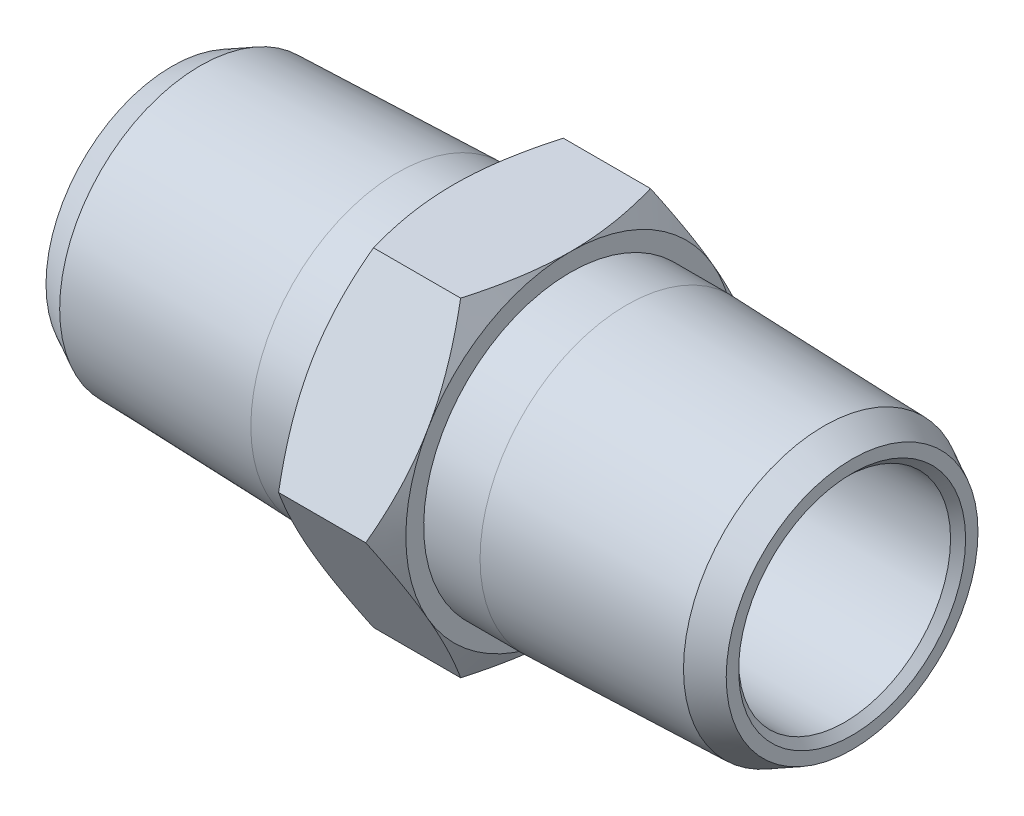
ISO-10303-21;
HEADER;
FILE_DESCRIPTION(('STEP AP214'),'2;1');
FILE_NAME('part.step','',(''),(''),'','','');
FILE_SCHEMA(('AUTOMOTIVE_DESIGN { 1 0 10303 214 1 1 1 1 }'));
ENDSEC;
DATA;
#1=APPLICATION_CONTEXT('core data for automotive mechanical design processes');
#2=APPLICATION_PROTOCOL_DEFINITION('international standard','automotive_design',2000,#1);
#3=PRODUCT_CONTEXT('',#1,'mechanical');
#4=PRODUCT('Part','Part','',(#3));
#5=PRODUCT_RELATED_PRODUCT_CATEGORY('part','',(#4));
#6=PRODUCT_DEFINITION_FORMATION('','',#4);
#7=PRODUCT_DEFINITION_CONTEXT('part definition',#1,'design');
#8=PRODUCT_DEFINITION('design','',#6,#7);
#9=PRODUCT_DEFINITION_SHAPE('','',#8);
#10=(LENGTH_UNIT() NAMED_UNIT(*) SI_UNIT(.MILLI.,.METRE.));
#11=(NAMED_UNIT(*) PLANE_ANGLE_UNIT() SI_UNIT($,.RADIAN.));
#12=(NAMED_UNIT(*) SI_UNIT($,.STERADIAN.) SOLID_ANGLE_UNIT());
#13=UNCERTAINTY_MEASURE_WITH_UNIT(LENGTH_MEASURE(1.E-05),#10,'distance_accuracy_value','');
#14=(GEOMETRIC_REPRESENTATION_CONTEXT(3) GLOBAL_UNCERTAINTY_ASSIGNED_CONTEXT((#13)) GLOBAL_UNIT_ASSIGNED_CONTEXT((#10,
#11,#12)) REPRESENTATION_CONTEXT('',''));
#15=CARTESIAN_POINT('',(0.,0.,0.));
#16=DIRECTION('',(0.,0.,1.));
#17=DIRECTION('',(1.,0.,0.));
#18=AXIS2_PLACEMENT_3D('',#15,#16,#17);
#19=CARTESIAN_POINT('',(0.,0.,-12.8316097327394));
#20=DIRECTION('',(0.,-0.5,-0.866025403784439));
#21=DIRECTION('',(0.,0.866025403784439,-0.5));
#22=AXIS2_PLACEMENT_3D('',#19,#20,#21);
#23=PLANE('',#22);
#24=CARTESIAN_POINT('',(-2.94447154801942,-2.12642103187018E-08,-12.8316097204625));
#25=CARTESIAN_POINT('',(-3.09528296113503,-0.452484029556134,-12.5703679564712));
#26=CARTESIAN_POINT('',(-3.23343498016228,-0.908289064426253,-12.307208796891));
#27=CARTESIAN_POINT('',(-3.41630997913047,-1.59559749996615,-11.9103910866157));
#28=CARTESIAN_POINT('',(-3.47309937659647,-1.82473210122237,-11.7781001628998));
#29=CARTESIAN_POINT('',(-3.57790298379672,-2.28450344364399,-11.512651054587));
#30=CARTESIAN_POINT('',(-3.62591772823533,-2.51514009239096,-11.3794929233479));
#31=CARTESIAN_POINT('',(-3.71240689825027,-2.97804211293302,-11.1122363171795));
#32=CARTESIAN_POINT('',(-3.75086974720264,-3.21030911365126,-10.978136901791));
#33=CARTESIAN_POINT('',(-3.81744708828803,-3.67595403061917,-10.7092966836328));
#34=CARTESIAN_POINT('',(-3.8455618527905,-3.90933191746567,-10.574555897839));
#35=CARTESIAN_POINT('',(-3.89095324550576,-4.3780631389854,-10.303933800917));
#36=CARTESIAN_POINT('',(-3.90817475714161,-4.61342050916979,-10.1680501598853));
#37=CARTESIAN_POINT('',(-3.93122211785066,-5.08459812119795,-9.89601563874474));
#38=CARTESIAN_POINT('',(-3.93704571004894,-5.32041844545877,-9.75986471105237));
#39=CARTESIAN_POINT('',(-3.93700001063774,-5.55624999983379,-9.62370729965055));
#40=B_SPLINE_CURVE_WITH_KNOTS('',3,(#24,#25,#26,#27,#28,#29,#30,#31,#32,#33,#34,#35,#36,#37,#38,
#39),.UNSPECIFIED.,.F.,.F.,(4,2,2,2,2,2,2,4),(0.,1.63139646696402,2.44310867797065,
3.2547714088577,4.06741310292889,4.88003340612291,5.69673310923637,6.51359450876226),.UNSPECIFIED.);
#41=CARTESIAN_POINT('',(-2.94447154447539,1.06320868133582E-08,-12.831609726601));
#42=VERTEX_POINT('',#41);
#43=CARTESIAN_POINT('',(-3.93700000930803,-5.55625000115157,-9.62370730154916));
#44=VERTEX_POINT('',#43);
#45=EDGE_CURVE('E289',#42,#44,#40,.T.);
#46=ORIENTED_EDGE('',*,*,#45,.F.);
#47=DIRECTION('',(1.,0.,0.));
#48=VECTOR('',#47,1.);
#49=CARTESIAN_POINT('',(0.,0.,-12.8316097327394));
#50=LINE('',#49,#48);
#51=CARTESIAN_POINT('',(2.9444715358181,1.53397640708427E-08,-12.8316097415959));
#52=VERTEX_POINT('',#51);
#53=EDGE_CURVE('E134',#52,#42,#50,.F.);
#54=ORIENTED_EDGE('',*,*,#53,.F.);
#55=CARTESIAN_POINT('',(3.93700000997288,-5.55624999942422,-9.6237072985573));
#56=CARTESIAN_POINT('',(3.93704570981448,-5.3204184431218,-9.75986471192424));
#57=CARTESIAN_POINT('',(3.93122211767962,-5.08459811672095,-9.89601564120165));
#58=CARTESIAN_POINT('',(3.90817475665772,-4.613420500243,-10.1680501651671));
#59=CARTESIAN_POINT('',(3.89095324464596,-4.37806312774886,-10.3039338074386));
#60=CARTESIAN_POINT('',(3.84556185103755,-3.90933190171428,-10.5745559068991));
#61=CARTESIAN_POINT('',(3.81744708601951,-3.67595401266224,-10.7092966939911));
#62=CARTESIAN_POINT('',(3.75086974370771,-3.21030909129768,-10.9781369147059));
#63=CARTESIAN_POINT('',(3.71240689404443,-2.97804208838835,-11.1122363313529));
#64=CARTESIAN_POINT('',(3.62591772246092,-2.51514006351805,-11.3794929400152));
#65=CARTESIAN_POINT('',(3.57790297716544,-2.28450341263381,-11.51265107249));
#66=CARTESIAN_POINT('',(3.47309936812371,-1.82473206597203,-11.7781001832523));
#67=CARTESIAN_POINT('',(3.41630996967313,-1.59559746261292,-11.9103911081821));
#68=CARTESIAN_POINT('',(3.23343496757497,-0.908289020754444,-12.3072088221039));
#69=CARTESIAN_POINT('',(3.09528294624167,-0.452483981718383,-12.5703679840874));
#70=CARTESIAN_POINT('',(2.94447153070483,3.06795427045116E-08,-12.8316097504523));
#71=B_SPLINE_CURVE_WITH_KNOTS('',3,(#55,#56,#57,#58,#59,#60,#61,#62,#63,#64,#65,#66,#67,#68,#69,
#70),.UNSPECIFIED.,.F.,.F.,(4,2,2,2,2,2,2,4),(0.,0.81686140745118,1.63356111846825,
2.44618142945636,3.25882313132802,4.07048586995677,4.88219808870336,6.51359457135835),.UNSPECIFIED.);
#72=CARTESIAN_POINT('',(3.93700000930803,-5.55625000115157,-9.62370730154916));
#73=VERTEX_POINT('',#72);
#74=EDGE_CURVE('E132',#73,#52,#71,.T.);
#75=ORIENTED_EDGE('',*,*,#74,.F.);
#76=CARTESIAN_POINT('',(2.94447156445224,-11.1124999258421,-6.41580490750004));
#77=CARTESIAN_POINT('',(3.09528297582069,-10.6600159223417,-6.67704666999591));
#78=CARTESIAN_POINT('',(3.23343499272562,-10.204210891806,-6.94020582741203));
#79=CARTESIAN_POINT('',(3.41630998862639,-9.51690246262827,-7.33702353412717));
#80=CARTESIAN_POINT('',(3.47309938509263,-9.28776786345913,-7.46931445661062));
#81=CARTESIAN_POINT('',(3.57790299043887,-8.8279965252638,-7.73476356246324));
#82=CARTESIAN_POINT('',(3.62591773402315,-8.59735987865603,-7.8679216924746));
#83=CARTESIAN_POINT('',(3.7124069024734,-8.13445786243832,-8.13517829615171));
#84=CARTESIAN_POINT('',(3.7508697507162,-7.90219086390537,-8.2692777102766));
#85=CARTESIAN_POINT('',(3.81744709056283,-7.43654595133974,-8.53811792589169));
#86=CARTESIAN_POINT('',(3.84556185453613,-7.20316806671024,-8.67285871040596));
#87=CARTESIAN_POINT('',(3.89095324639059,-6.73443684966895,-8.94348080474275));
#88=CARTESIAN_POINT('',(3.90817475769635,-6.49907948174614,-9.07936444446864));
#89=CARTESIAN_POINT('',(3.93122211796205,-6.02790187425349,-9.35139896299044));
#90=CARTESIAN_POINT('',(3.93704571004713,-5.7920815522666,-9.48754988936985));
#91=CARTESIAN_POINT('',(3.93700001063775,-5.55625000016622,-9.62370729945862));
#92=B_SPLINE_CURVE_WITH_KNOTS('',3,(#76,#77,#78,#79,#80,#81,#82,#83,#84,#85,#86,#87,#88,#89,#90,
#91),.UNSPECIFIED.,.F.,.F.,(4,2,2,2,2,2,2,4),(0.,1.63139645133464,2.44310865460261,
3.25477137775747,4.06741306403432,4.88003335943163,5.69673305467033,6.51359444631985),.UNSPECIFIED.);
#93=CARTESIAN_POINT('',(2.9444715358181,-11.1125,-6.41580488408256));
#94=VERTEX_POINT('',#93);
#95=EDGE_CURVE('E20',#94,#73,#92,.T.);
#96=ORIENTED_EDGE('',*,*,#95,.F.);
#97=DIRECTION('',(1.,0.,0.));
#98=VECTOR('',#97,1.);
#99=CARTESIAN_POINT('',(0.,-11.1125,-6.41580486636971));
#100=LINE('',#99,#98);
#101=CARTESIAN_POINT('',(-2.94447155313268,-11.112499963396,-6.41580488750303));
#102=VERTEX_POINT('',#101);
#103=EDGE_CURVE('E109',#102,#94,#100,.T.);
#104=ORIENTED_EDGE('',*,*,#103,.F.);
#105=CARTESIAN_POINT('',(-3.93700000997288,-5.55624999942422,-9.62370729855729));
#106=CARTESIAN_POINT('',(-3.93704570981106,-5.79208155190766,-9.4875498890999));
#107=CARTESIAN_POINT('',(-3.9312221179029,-6.02790187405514,-9.35139896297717));
#108=CARTESIAN_POINT('',(-3.90817475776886,-6.49907948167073,-9.07936444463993));
#109=CARTESIAN_POINT('',(-3.89095324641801,-6.73443684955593,-8.94348080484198));
#110=CARTESIAN_POINT('',(-3.84556185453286,-7.20316806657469,-8.67285871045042));
#111=CARTESIAN_POINT('',(-3.81744709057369,-7.43654595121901,-8.53811792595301));
#112=CARTESIAN_POINT('',(-3.75086975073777,-7.90219086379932,-8.26927771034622));
#113=CARTESIAN_POINT('',(-3.71240690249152,-8.13445786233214,-8.13517829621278));
#114=CARTESIAN_POINT('',(-3.62591773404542,-8.597359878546,-7.86792169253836));
#115=CARTESIAN_POINT('',(-3.57790299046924,-8.82799652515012,-7.7347635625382));
#116=CARTESIAN_POINT('',(-3.47309938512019,-9.28776786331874,-7.46931445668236));
#117=CARTESIAN_POINT('',(-3.41630998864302,-9.5169024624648,-7.33702353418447));
#118=CARTESIAN_POINT('',(-3.2334349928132,-10.2042108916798,-6.94020582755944));
#119=CARTESIAN_POINT('',(-3.09528297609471,-10.6600159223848,-6.67704667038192));
#120=CARTESIAN_POINT('',(-2.94447156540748,-11.1124999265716,-6.41580490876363));
#121=B_SPLINE_CURVE_WITH_KNOTS('',3,(#105,#106,#107,#108,#109,#110,#111,#112,#113,#114,#115,
#116,#117,#118,#119,#120),.UNSPECIFIED.,.F.,.F.,(4,2,2,2,2,2,2,4),(0.,0.816861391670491,
1.63356108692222,2.44618138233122,3.25882306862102,4.07048579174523,4.88219799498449,
6.51359444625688),.UNSPECIFIED.);
#122=EDGE_CURVE('E192',#44,#102,#121,.T.);
#123=ORIENTED_EDGE('',*,*,#122,.F.);
#124=EDGE_LOOP('',(#46,#54,#75,#96,#104,#123));
#125=FACE_BOUND('',#124,.T.);
#126=ADVANCED_FACE('F16',(#125),#23,.T.);
#127=CARTESIAN_POINT('',(0.,11.1125,-6.41580486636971));
#128=DIRECTION('',(0.,0.5,-0.866025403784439));
#129=DIRECTION('',(0.,0.866025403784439,0.5));
#130=AXIS2_PLACEMENT_3D('',#127,#128,#129);
#131=PLANE('',#130);
#132=CARTESIAN_POINT('',(-2.94447153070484,11.1125000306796,-6.41580484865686));
#133=CARTESIAN_POINT('',(-3.09528294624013,10.6600160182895,-6.67704661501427));
#134=CARTESIAN_POINT('',(-3.2334349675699,10.2042109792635,-6.94020577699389));
#135=CARTESIAN_POINT('',(-3.41630996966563,9.51690253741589,-7.33702349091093));
#136=CARTESIAN_POINT('',(-3.47309936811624,9.28776793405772,-7.46931441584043));
#137=CARTESIAN_POINT('',(-3.57790297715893,8.82799658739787,-7.73476352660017));
#138=CARTESIAN_POINT('',(-3.62591772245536,8.59735993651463,-7.8679216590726));
#139=CARTESIAN_POINT('',(-3.71240689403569,8.13445791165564,-8.13517826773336));
#140=CARTESIAN_POINT('',(-3.75086974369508,7.90219090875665,-8.26927768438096));
#141=CARTESIAN_POINT('',(-3.81744708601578,7.43654598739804,-8.53811790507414));
#142=CARTESIAN_POINT('',(-3.84556185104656,7.20316809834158,-8.67285869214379));
#143=CARTESIAN_POINT('',(-3.89095324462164,6.73443687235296,-8.94348079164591));
#144=CARTESIAN_POINT('',(-3.90817475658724,6.49907949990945,-9.07936443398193));
#145=CARTESIAN_POINT('',(-3.93122211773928,6.02790188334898,-9.35139895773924));
#146=CARTESIAN_POINT('',(-3.93704571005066,5.79208155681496,-9.48754988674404));
#147=CARTESIAN_POINT('',(-3.93700001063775,5.55625000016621,-9.62370729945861));
#148=B_SPLINE_CURVE_WITH_KNOTS('',3,(#132,#133,#134,#135,#136,#137,#138,#139,#140,#141,#142,
#143,#144,#145,#146,#147),.UNSPECIFIED.,.F.,.F.,(4,2,2,2,2,2,2,4),(0.,1.6313964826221,
2.44310870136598,3.25477143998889,4.06741314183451,4.8800334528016,5.69673316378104,
6.51359457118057),.UNSPECIFIED.);
#149=CARTESIAN_POINT('',(-2.94447155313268,11.1125,-6.41580482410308));
#150=VERTEX_POINT('',#149);
#151=CARTESIAN_POINT('',(-3.93700000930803,5.55625000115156,-9.62370730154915));
#152=VERTEX_POINT('',#151);
#153=EDGE_CURVE('E278',#150,#152,#148,.T.);
#154=ORIENTED_EDGE('',*,*,#153,.F.);
#155=DIRECTION('',(1.,0.,0.));
#156=VECTOR('',#155,1.);
#157=CARTESIAN_POINT('',(0.,11.1125,-6.41580486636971));
#158=LINE('',#157,#156);
#159=CARTESIAN_POINT('',(2.9444715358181,11.1125000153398,-6.41580485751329));
#160=VERTEX_POINT('',#159);
#161=EDGE_CURVE('E394',#160,#150,#158,.F.);
#162=ORIENTED_EDGE('',*,*,#161,.F.);
#163=CARTESIAN_POINT('',(3.9370000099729,5.55624999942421,-9.62370729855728));
#164=CARTESIAN_POINT('',(3.93704570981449,5.79208155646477,-9.48754988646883));
#165=CARTESIAN_POINT('',(3.93122211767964,6.02790188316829,-9.35139895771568));
#166=CARTESIAN_POINT('',(3.90817475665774,6.49907949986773,-9.07936443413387));
#167=CARTESIAN_POINT('',(3.89095324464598,6.73443687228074,-8.94348079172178));
#168=CARTESIAN_POINT('',(3.84556185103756,7.20316809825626,-8.67285869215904));
#169=CARTESIAN_POINT('',(3.81744708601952,7.43654598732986,-8.53811790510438));
#170=CARTESIAN_POINT('',(3.75086974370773,7.90219090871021,-8.26927768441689));
#171=CARTESIAN_POINT('',(3.71240689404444,8.13445791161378,-8.13517826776));
#172=CARTESIAN_POINT('',(3.62591772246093,8.59735993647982,-7.86792165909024));
#173=CARTESIAN_POINT('',(3.57790297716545,8.82799658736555,-7.73476352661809));
#174=CARTESIAN_POINT('',(3.47309936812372,9.28776793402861,-7.46931441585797));
#175=CARTESIAN_POINT('',(3.41630996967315,9.5169025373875,-7.33702349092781));
#176=CARTESIAN_POINT('',(3.23343496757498,10.2042109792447,-6.94020577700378));
#177=CARTESIAN_POINT('',(3.09528294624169,10.660016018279,-6.67704661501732));
#178=CARTESIAN_POINT('',(2.94447153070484,11.1125000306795,-6.41580484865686));
#179=B_SPLINE_CURVE_WITH_KNOTS('',3,(#163,#164,#165,#166,#167,#168,#169,#170,#171,#172,#173,
#174,#175,#176,#177,#178),.UNSPECIFIED.,.F.,.F.,(4,2,2,2,2,2,2,4),(0.,0.816861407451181,
1.63356111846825,2.44618142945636,3.25882313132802,4.07048586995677,4.88219808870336,
6.51359457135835),.UNSPECIFIED.);
#180=CARTESIAN_POINT('',(3.93700000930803,5.55625000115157,-9.62370730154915));
#181=VERTEX_POINT('',#180);
#182=EDGE_CURVE('E327',#181,#160,#179,.T.);
#183=ORIENTED_EDGE('',*,*,#182,.F.);
#184=CARTESIAN_POINT('',(2.94447156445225,7.26988509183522E-08,-12.831609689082));
#185=CARTESIAN_POINT('',(3.09528297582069,0.452484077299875,-12.5703679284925));
#186=CARTESIAN_POINT('',(3.23343499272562,0.908289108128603,-12.3072087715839));
#187=CARTESIAN_POINT('',(3.41630998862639,1.59559753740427,-11.9103910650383));
#188=CARTESIAN_POINT('',(3.47309938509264,1.82473213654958,-11.7781001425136));
#189=CARTESIAN_POINT('',(3.57790299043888,2.28450347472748,-11.5126510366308));
#190=CARTESIAN_POINT('',(3.62591773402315,2.51514012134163,-11.3794929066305));
#191=CARTESIAN_POINT('',(3.7124069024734,2.97804213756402,-11.1122363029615));
#192=CARTESIAN_POINT('',(3.75086975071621,3.21030913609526,-10.9781368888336));
#193=CARTESIAN_POINT('',(3.81744709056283,3.67595404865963,-10.7092966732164));
#194=CARTESIAN_POINT('',(3.84556185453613,3.90933193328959,-10.5745558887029));
#195=CARTESIAN_POINT('',(3.8909532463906,4.37806315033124,-10.3039337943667));
#196=CARTESIAN_POINT('',(3.90817475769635,4.61342051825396,-10.1680501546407));
#197=CARTESIAN_POINT('',(3.93122211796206,5.08459812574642,-9.89601563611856));
#198=CARTESIAN_POINT('',(3.93704571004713,5.32041844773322,-9.75986470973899));
#199=CARTESIAN_POINT('',(3.93700001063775,5.55624999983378,-9.62370729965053));
#200=B_SPLINE_CURVE_WITH_KNOTS('',3,(#184,#185,#186,#187,#188,#189,#190,#191,#192,#193,#194,
#195,#196,#197,#198,#199),.UNSPECIFIED.,.F.,.F.,(4,2,2,2,2,2,2,4),(0.,1.63139645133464,
2.4431086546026,3.25477137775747,4.06741306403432,4.88003335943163,5.69673305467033,
6.51359444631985),.UNSPECIFIED.);
#201=EDGE_CURVE('E128',#52,#181,#200,.T.);
#202=ORIENTED_EDGE('',*,*,#201,.F.);
#203=ORIENTED_EDGE('',*,*,#53,.T.);
#204=CARTESIAN_POINT('',(-3.93700000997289,5.55624999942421,-9.62370729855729));
#205=CARTESIAN_POINT('',(-3.93704570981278,5.32041844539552,-9.75986471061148));
#206=CARTESIAN_POINT('',(-3.93122211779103,5.08459812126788,-9.89601563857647));
#207=CARTESIAN_POINT('',(-3.90817475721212,4.61342050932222,-10.1680501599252));
#208=CARTESIAN_POINT('',(-3.89095324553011,4.3780631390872,-10.3039338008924));
#209=CARTESIAN_POINT('',(-3.84556185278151,3.90933191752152,-10.5745558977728));
#210=CARTESIAN_POINT('',(-3.81744708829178,3.67595403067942,-10.7092966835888));
#211=CARTESIAN_POINT('',(-3.7508697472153,3.21030911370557,-10.9781369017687));
#212=CARTESIAN_POINT('',(-3.71240689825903,2.97804211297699,-11.1122363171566));
#213=CARTESIAN_POINT('',(-3.6259177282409,2.51514009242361,-11.3794929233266));
#214=CARTESIAN_POINT('',(-3.57790298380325,2.28450344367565,-11.5126510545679));
#215=CARTESIAN_POINT('',(-3.47309937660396,1.82473210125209,-11.7781001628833));
#216=CARTESIAN_POINT('',(-3.41630997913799,1.59559749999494,-11.9103910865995));
#217=CARTESIAN_POINT('',(-3.23343498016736,0.908289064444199,-12.3072087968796));
#218=CARTESIAN_POINT('',(-3.09528296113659,0.452484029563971,-12.5703679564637));
#219=CARTESIAN_POINT('',(-2.94447154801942,2.1264189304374E-08,-12.8316097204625));
#220=B_SPLINE_CURVE_WITH_KNOTS('',3,(#204,#205,#206,#207,#208,#209,#210,#211,#212,#213,#214,
#215,#216,#217,#218,#219),.UNSPECIFIED.,.F.,.F.,(4,2,2,2,2,2,2,4),(0.,0.816861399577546,
1.63356110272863,2.44618140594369,3.25882310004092,4.07048583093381,4.88219804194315,
6.51359450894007),.UNSPECIFIED.);
#221=EDGE_CURVE('E293',#152,#42,#220,.T.);
#222=ORIENTED_EDGE('',*,*,#221,.F.);
#223=EDGE_LOOP('',(#154,#162,#183,#202,#203,#222));
#224=FACE_BOUND('',#223,.T.);
#225=ADVANCED_FACE('F300',(#224),#131,.T.);
#226=CARTESIAN_POINT('',(0.,11.1125,6.41580486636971));
#227=DIRECTION('',(0.,1.,0.));
#228=DIRECTION('',(0.,0.,1.));
#229=AXIS2_PLACEMENT_3D('',#226,#227,#228);
#230=PLANE('',#229);
#231=CARTESIAN_POINT('',(-2.94447156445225,11.112499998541,6.41580478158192));
#232=CARTESIAN_POINT('',(-3.0952829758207,11.1124999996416,5.89332125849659));
#233=CARTESIAN_POINT('',(-3.23343499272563,11.1124999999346,5.36700294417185));
#234=CARTESIAN_POINT('',(-3.4163099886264,11.1125000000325,4.57336753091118));
#235=CARTESIAN_POINT('',(-3.47309938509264,11.1125000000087,4.30878568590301));
#236=CARTESIAN_POINT('',(-3.57790299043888,11.1124999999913,3.77788747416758));
#237=CARTESIAN_POINT('',(-3.62591773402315,11.1124999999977,3.51157121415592));
#238=CARTESIAN_POINT('',(-3.7124069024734,11.1125000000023,2.97705800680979));
#239=CARTESIAN_POINT('',(-3.75086975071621,11.1125000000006,2.70885917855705));
#240=CARTESIAN_POINT('',(-3.81744709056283,11.1124999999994,2.17117874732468));
#241=CARTESIAN_POINT('',(-3.84556185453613,11.1124999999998,1.90169717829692));
#242=CARTESIAN_POINT('',(-3.8909532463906,11.1125000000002,1.36045298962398));
#243=CARTESIAN_POINT('',(-3.90817475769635,11.1125000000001,1.08868571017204));
#244=CARTESIAN_POINT('',(-3.93122211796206,11.1124999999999,0.544616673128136));
#245=CARTESIAN_POINT('',(-3.93704571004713,11.1124999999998,0.272314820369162));
#246=CARTESIAN_POINT('',(-3.93700001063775,11.1125,1.91929935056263E-10));
#247=B_SPLINE_CURVE_WITH_KNOTS('',3,(#231,#232,#233,#234,#235,#236,#237,#238,#239,#240,#241,
#242,#243,#244,#245,#246),.UNSPECIFIED.,.F.,.F.,(4,2,2,2,2,2,2,4),(0.,1.63139645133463,
2.4431086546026,3.25477137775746,4.06741306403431,4.88003335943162,5.69673305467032,
6.51359444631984),.UNSPECIFIED.);
#248=CARTESIAN_POINT('',(-2.94447153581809,11.1125000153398,6.4158048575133));
#249=VERTEX_POINT('',#248);
#250=CARTESIAN_POINT('',(-3.93700000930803,11.1125000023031,0.));
#251=VERTEX_POINT('',#250);
#252=EDGE_CURVE('E258',#249,#251,#247,.T.);
#253=ORIENTED_EDGE('',*,*,#252,.F.);
#254=DIRECTION('',(1.,0.,0.));
#255=VECTOR('',#254,1.);
#256=CARTESIAN_POINT('',(0.,11.1125,6.41580486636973));
#257=LINE('',#256,#255);
#258=CARTESIAN_POINT('',(2.94447155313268,11.1125,6.41580482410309));
#259=VERTEX_POINT('',#258);
#260=EDGE_CURVE('E396',#259,#249,#257,.F.);
#261=ORIENTED_EDGE('',*,*,#260,.F.);
#262=CARTESIAN_POINT('',(3.93700000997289,11.1124999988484,0.));
#263=CARTESIAN_POINT('',(3.93704570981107,11.1124999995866,0.272314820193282));
#264=CARTESIAN_POINT('',(3.93122211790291,11.1124999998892,0.54461667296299));
#265=CARTESIAN_POINT('',(3.90817475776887,11.1125000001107,1.08868571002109));
#266=CARTESIAN_POINT('',(3.89095324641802,11.1125000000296,1.36045298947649));
#267=CARTESIAN_POINT('',(3.84556185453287,11.1124999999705,1.90169717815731));
#268=CARTESIAN_POINT('',(3.81744709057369,11.1124999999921,2.17117874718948));
#269=CARTESIAN_POINT('',(3.75086975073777,11.1125000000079,2.7088591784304));
#270=CARTESIAN_POINT('',(3.71240690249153,11.1125000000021,2.97705800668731));
#271=CARTESIAN_POINT('',(3.62591773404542,11.1124999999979,3.51157121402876));
#272=CARTESIAN_POINT('',(3.57790299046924,11.1124999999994,3.77788747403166));
#273=CARTESIAN_POINT('',(3.47309938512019,11.1125000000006,4.30878568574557));
#274=CARTESIAN_POINT('',(3.41630998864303,11.1125000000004,4.57336753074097));
#275=CARTESIAN_POINT('',(3.2334349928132,11.1124999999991,5.36700294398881));
#276=CARTESIAN_POINT('',(3.09528297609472,11.1124999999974,5.89332125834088));
#277=CARTESIAN_POINT('',(2.94447156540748,11.1125,6.41580478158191));
#278=B_SPLINE_CURVE_WITH_KNOTS('',3,(#262,#263,#264,#265,#266,#267,#268,#269,#270,#271,#272,
#273,#274,#275,#276,#277),.UNSPECIFIED.,.F.,.F.,(4,2,2,2,2,2,2,4),(0.,0.816861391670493,
1.63356108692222,2.44618138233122,3.25882306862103,4.07048579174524,4.8821979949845,
6.51359444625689),.UNSPECIFIED.);
#279=CARTESIAN_POINT('',(3.93700000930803,11.1125000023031,0.));
#280=VERTEX_POINT('',#279);
#281=EDGE_CURVE('E332',#280,#259,#278,.T.);
#282=ORIENTED_EDGE('',*,*,#281,.F.);
#283=CARTESIAN_POINT('',(2.94447156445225,11.1124999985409,-6.41580478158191));
#284=CARTESIAN_POINT('',(3.0952829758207,11.1124999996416,-5.89332125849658));
#285=CARTESIAN_POINT('',(3.23343499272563,11.1124999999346,-5.36700294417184));
#286=CARTESIAN_POINT('',(3.4163099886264,11.1125000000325,-4.57336753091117));
#287=CARTESIAN_POINT('',(3.47309938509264,11.1125000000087,-4.30878568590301));
#288=CARTESIAN_POINT('',(3.57790299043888,11.1124999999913,-3.77788747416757));
#289=CARTESIAN_POINT('',(3.62591773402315,11.1124999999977,-3.51157121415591));
#290=CARTESIAN_POINT('',(3.7124069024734,11.1125000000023,-2.97705800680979));
#291=CARTESIAN_POINT('',(3.75086975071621,11.1125000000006,-2.70885917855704));
#292=CARTESIAN_POINT('',(3.81744709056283,11.1124999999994,-2.17117874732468));
#293=CARTESIAN_POINT('',(3.84556185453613,11.1124999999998,-1.90169717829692));
#294=CARTESIAN_POINT('',(3.8909532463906,11.1125000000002,-1.36045298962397));
#295=CARTESIAN_POINT('',(3.90817475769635,11.1125000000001,-1.08868571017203));
#296=CARTESIAN_POINT('',(3.93122211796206,11.1124999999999,-0.544616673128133));
#297=CARTESIAN_POINT('',(3.93704571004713,11.1124999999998,-0.272314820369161));
#298=CARTESIAN_POINT('',(3.93700001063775,11.1125,-1.91929374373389E-10));
#299=B_SPLINE_CURVE_WITH_KNOTS('',3,(#283,#284,#285,#286,#287,#288,#289,#290,#291,#292,#293,
#294,#295,#296,#297,#298),.UNSPECIFIED.,.F.,.F.,(4,2,2,2,2,2,2,4),(0.,1.63139645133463,
2.4431086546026,3.25477137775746,4.06741306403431,4.88003335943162,5.69673305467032,
6.51359444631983),.UNSPECIFIED.);
#300=EDGE_CURVE('E137',#160,#280,#299,.T.);
#301=ORIENTED_EDGE('',*,*,#300,.F.);
#302=ORIENTED_EDGE('',*,*,#161,.T.);
#303=CARTESIAN_POINT('',(-3.93700000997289,11.1124999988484,0.));
#304=CARTESIAN_POINT('',(-3.93704570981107,11.1124999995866,-0.272314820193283));
#305=CARTESIAN_POINT('',(-3.93122211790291,11.1124999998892,-0.54461667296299));
#306=CARTESIAN_POINT('',(-3.90817475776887,11.1125000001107,-1.08868571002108));
#307=CARTESIAN_POINT('',(-3.89095324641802,11.1125000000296,-1.36045298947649));
#308=CARTESIAN_POINT('',(-3.84556185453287,11.1124999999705,-1.90169717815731));
#309=CARTESIAN_POINT('',(-3.81744709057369,11.1124999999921,-2.17117874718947));
#310=CARTESIAN_POINT('',(-3.75086975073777,11.1125000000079,-2.7088591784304));
#311=CARTESIAN_POINT('',(-3.71240690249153,11.1125000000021,-2.9770580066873));
#312=CARTESIAN_POINT('',(-3.62591773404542,11.1124999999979,-3.51157121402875));
#313=CARTESIAN_POINT('',(-3.57790299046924,11.1124999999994,-3.77788747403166));
#314=CARTESIAN_POINT('',(-3.47309938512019,11.1125000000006,-4.30878568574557));
#315=CARTESIAN_POINT('',(-3.41630998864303,11.1125000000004,-4.57336753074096));
#316=CARTESIAN_POINT('',(-3.2334349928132,11.1124999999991,-5.3670029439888));
#317=CARTESIAN_POINT('',(-3.09528297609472,11.1124999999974,-5.89332125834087));
#318=CARTESIAN_POINT('',(-2.94447156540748,11.1125,-6.4158047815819));
#319=B_SPLINE_CURVE_WITH_KNOTS('',3,(#303,#304,#305,#306,#307,#308,#309,#310,#311,#312,#313,
#314,#315,#316,#317,#318),.UNSPECIFIED.,.F.,.F.,(4,2,2,2,2,2,2,4),(0.,0.816861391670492,
1.63356108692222,2.44618138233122,3.25882306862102,4.07048579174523,4.8821979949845,
6.51359444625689),.UNSPECIFIED.);
#320=EDGE_CURVE('E283',#251,#150,#319,.T.);
#321=ORIENTED_EDGE('',*,*,#320,.F.);
#322=EDGE_LOOP('',(#253,#261,#282,#301,#302,#321));
#323=FACE_BOUND('',#322,.T.);
#324=ADVANCED_FACE('F238',(#323),#230,.T.);
#325=CARTESIAN_POINT('',(0.,0.,12.8316097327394));
#326=DIRECTION('',(0.,0.5,0.866025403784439));
#327=DIRECTION('',(0.,-0.866025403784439,0.5));
#328=AXIS2_PLACEMENT_3D('',#325,#326,#327);
#329=PLANE('',#328);
#330=DIRECTION('',(1.,0.,0.));
#331=VECTOR('',#330,1.);
#332=CARTESIAN_POINT('',(0.,0.,12.8316097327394));
#333=LINE('',#332,#331);
#334=CARTESIAN_POINT('',(2.94447154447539,1.06321115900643E-08,12.831609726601));
#335=VERTEX_POINT('',#334);
#336=CARTESIAN_POINT('',(-2.9444715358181,1.53397885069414E-08,12.8316097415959));
#337=VERTEX_POINT('',#336);
#338=EDGE_CURVE('E351',#335,#337,#333,.F.);
#339=ORIENTED_EDGE('',*,*,#338,.F.);
#340=CARTESIAN_POINT('',(3.93700000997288,5.55624999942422,9.6237072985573));
#341=CARTESIAN_POINT('',(3.93704570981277,5.32041844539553,9.7598647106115));
#342=CARTESIAN_POINT('',(3.93122211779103,5.08459812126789,9.89601563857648));
#343=CARTESIAN_POINT('',(3.90817475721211,4.61342050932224,10.1680501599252));
#344=CARTESIAN_POINT('',(3.89095324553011,4.37806313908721,10.3039338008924));
#345=CARTESIAN_POINT('',(3.8455618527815,3.90933191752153,10.5745558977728));
#346=CARTESIAN_POINT('',(3.81744708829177,3.67595403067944,10.7092966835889));
#347=CARTESIAN_POINT('',(3.75086974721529,3.21030911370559,10.9781369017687));
#348=CARTESIAN_POINT('',(3.71240689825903,2.978042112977,11.1122363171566));
#349=CARTESIAN_POINT('',(3.6259177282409,2.51514009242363,11.3794929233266));
#350=CARTESIAN_POINT('',(3.57790298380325,2.28450344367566,11.5126510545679));
#351=CARTESIAN_POINT('',(3.47309937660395,1.82473210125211,11.7781001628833));
#352=CARTESIAN_POINT('',(3.41630997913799,1.59559749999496,11.9103910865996));
#353=CARTESIAN_POINT('',(3.23343498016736,0.908289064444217,12.3072087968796));
#354=CARTESIAN_POINT('',(3.09528296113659,0.45248402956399,12.5703679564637));
#355=CARTESIAN_POINT('',(2.94447154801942,2.12642095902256E-08,12.8316097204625));
#356=B_SPLINE_CURVE_WITH_KNOTS('',3,(#340,#341,#342,#343,#344,#345,#346,#347,#348,#349,#350,
#351,#352,#353,#354,#355),.UNSPECIFIED.,.F.,.F.,(4,2,2,2,2,2,2,4),(0.,0.816861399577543,
1.63356110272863,2.44618140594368,3.25882310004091,4.0704858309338,4.88219804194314,
6.51359450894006),.UNSPECIFIED.);
#357=CARTESIAN_POINT('',(3.93700000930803,5.55625000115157,9.62370730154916));
#358=VERTEX_POINT('',#357);
#359=EDGE_CURVE('E224',#358,#335,#356,.T.);
#360=ORIENTED_EDGE('',*,*,#359,.F.);
#361=CARTESIAN_POINT('',(2.94447153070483,11.1125000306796,6.41580484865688));
#362=CARTESIAN_POINT('',(3.09528294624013,10.6600160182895,6.67704661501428));
#363=CARTESIAN_POINT('',(3.2334349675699,10.2042109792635,6.94020577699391));
#364=CARTESIAN_POINT('',(3.41630996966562,9.51690253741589,7.33702349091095));
#365=CARTESIAN_POINT('',(3.47309936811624,9.28776793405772,7.46931441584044));
#366=CARTESIAN_POINT('',(3.57790297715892,8.82799658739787,7.73476352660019));
#367=CARTESIAN_POINT('',(3.62591772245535,8.59735993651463,7.86792165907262));
#368=CARTESIAN_POINT('',(3.71240689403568,8.13445791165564,8.13517826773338));
#369=CARTESIAN_POINT('',(3.75086974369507,7.90219090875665,8.26927768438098));
#370=CARTESIAN_POINT('',(3.81744708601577,7.43654598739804,8.53811790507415));
#371=CARTESIAN_POINT('',(3.84556185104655,7.20316809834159,8.67285869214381));
#372=CARTESIAN_POINT('',(3.89095324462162,6.73443687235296,8.94348079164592));
#373=CARTESIAN_POINT('',(3.90817475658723,6.49907949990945,9.07936443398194));
#374=CARTESIAN_POINT('',(3.93122211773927,6.02790188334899,9.35139895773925));
#375=CARTESIAN_POINT('',(3.93704571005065,5.79208155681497,9.48754988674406));
#376=CARTESIAN_POINT('',(3.93700001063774,5.55625000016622,9.62370729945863));
#377=B_SPLINE_CURVE_WITH_KNOTS('',3,(#361,#362,#363,#364,#365,#366,#367,#368,#369,#370,#371,
#372,#373,#374,#375,#376),.UNSPECIFIED.,.F.,.F.,(4,2,2,2,2,2,2,4),(0.,1.6313964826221,
2.44310870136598,3.25477143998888,4.06741314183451,4.88003345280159,5.69673316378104,
6.51359457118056),.UNSPECIFIED.);
#378=EDGE_CURVE('E229',#259,#358,#377,.T.);
#379=ORIENTED_EDGE('',*,*,#378,.F.);
#380=ORIENTED_EDGE('',*,*,#260,.T.);
#381=CARTESIAN_POINT('',(-3.93700000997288,5.55624999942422,9.6237072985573));
#382=CARTESIAN_POINT('',(-3.93704570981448,5.79208155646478,9.48754988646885));
#383=CARTESIAN_POINT('',(-3.93122211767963,6.0279018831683,9.35139895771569));
#384=CARTESIAN_POINT('',(-3.90817475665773,6.49907949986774,9.07936443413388));
#385=CARTESIAN_POINT('',(-3.89095324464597,6.73443687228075,8.94348079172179));
#386=CARTESIAN_POINT('',(-3.84556185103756,7.20316809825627,8.67285869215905));
#387=CARTESIAN_POINT('',(-3.81744708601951,7.43654598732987,8.53811790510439));
#388=CARTESIAN_POINT('',(-3.75086974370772,7.90219090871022,8.2692776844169));
#389=CARTESIAN_POINT('',(-3.71240689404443,8.13445791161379,8.13517826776));
#390=CARTESIAN_POINT('',(-3.62591772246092,8.59735993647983,7.86792165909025));
#391=CARTESIAN_POINT('',(-3.57790297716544,8.82799658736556,7.7347635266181));
#392=CARTESIAN_POINT('',(-3.47309936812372,9.28776793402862,7.46931441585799));
#393=CARTESIAN_POINT('',(-3.41630996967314,9.51690253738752,7.33702349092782));
#394=CARTESIAN_POINT('',(-3.23343496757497,10.2042109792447,6.94020577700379));
#395=CARTESIAN_POINT('',(-3.09528294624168,10.660016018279,6.67704661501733));
#396=CARTESIAN_POINT('',(-2.94447153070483,11.1125000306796,6.41580484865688));
#397=B_SPLINE_CURVE_WITH_KNOTS('',3,(#381,#382,#383,#384,#385,#386,#387,#388,#389,#390,#391,
#392,#393,#394,#395,#396),.UNSPECIFIED.,.F.,.F.,(4,2,2,2,2,2,2,4),(0.,0.816861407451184,
1.63356111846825,2.44618142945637,3.25882313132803,4.07048586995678,4.88219808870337,
6.51359457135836),.UNSPECIFIED.);
#398=CARTESIAN_POINT('',(-3.93700000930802,5.55625000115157,9.62370730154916));
#399=VERTEX_POINT('',#398);
#400=EDGE_CURVE('E251',#399,#249,#397,.T.);
#401=ORIENTED_EDGE('',*,*,#400,.F.);
#402=CARTESIAN_POINT('',(-2.94447156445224,7.26988707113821E-08,12.831609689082));
#403=CARTESIAN_POINT('',(-3.09528297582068,0.452484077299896,12.5703679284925));
#404=CARTESIAN_POINT('',(-3.23343499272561,0.908289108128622,12.3072087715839));
#405=CARTESIAN_POINT('',(-3.41630998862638,1.59559753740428,11.9103910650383));
#406=CARTESIAN_POINT('',(-3.47309938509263,1.8247321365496,11.7781001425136));
#407=CARTESIAN_POINT('',(-3.57790299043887,2.2845034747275,11.5126510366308));
#408=CARTESIAN_POINT('',(-3.62591773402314,2.51514012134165,11.3794929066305));
#409=CARTESIAN_POINT('',(-3.71240690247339,2.97804213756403,11.1122363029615));
#410=CARTESIAN_POINT('',(-3.75086975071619,3.21030913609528,10.9781368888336));
#411=CARTESIAN_POINT('',(-3.81744709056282,3.67595404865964,10.7092966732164));
#412=CARTESIAN_POINT('',(-3.84556185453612,3.9093319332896,10.5745558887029));
#413=CARTESIAN_POINT('',(-3.89095324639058,4.37806315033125,10.3039337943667));
#414=CARTESIAN_POINT('',(-3.90817475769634,4.61342051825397,10.1680501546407));
#415=CARTESIAN_POINT('',(-3.93122211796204,5.08459812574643,9.89601563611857));
#416=CARTESIAN_POINT('',(-3.93704571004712,5.32041844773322,9.75986470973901));
#417=CARTESIAN_POINT('',(-3.93700001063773,5.55624999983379,9.62370729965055));
#418=B_SPLINE_CURVE_WITH_KNOTS('',3,(#402,#403,#404,#405,#406,#407,#408,#409,#410,#411,#412,
#413,#414,#415,#416,#417),.UNSPECIFIED.,.F.,.F.,(4,2,2,2,2,2,2,4),(0.,1.63139645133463,
2.4431086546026,3.25477137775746,4.06741306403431,4.88003335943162,5.69673305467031,
6.51359444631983),.UNSPECIFIED.);
#419=EDGE_CURVE('E246',#337,#399,#418,.T.);
#420=ORIENTED_EDGE('',*,*,#419,.F.);
#421=EDGE_LOOP('',(#339,#360,#379,#380,#401,#420));
#422=FACE_BOUND('',#421,.T.);
#423=ADVANCED_FACE('F234',(#422),#329,.T.);
#424=CARTESIAN_POINT('',(0.,-11.1125,6.41580486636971));
#425=DIRECTION('',(0.,-0.5,0.866025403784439));
#426=DIRECTION('',(0.,-0.866025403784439,-0.5));
#427=AXIS2_PLACEMENT_3D('',#424,#425,#426);
#428=PLANE('',#427);
#429=DIRECTION('',(1.,0.,0.));
#430=VECTOR('',#429,1.);
#431=CARTESIAN_POINT('',(0.,-11.1125,6.41580486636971));
#432=LINE('',#431,#430);
#433=CARTESIAN_POINT('',(2.94447155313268,-11.112499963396,6.41580488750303));
#434=VERTEX_POINT('',#433);
#435=CARTESIAN_POINT('',(-2.9444715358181,-11.1125,6.41580488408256));
#436=VERTEX_POINT('',#435);
#437=EDGE_CURVE('E120',#434,#436,#432,.F.);
#438=ORIENTED_EDGE('',*,*,#437,.F.);
#439=CARTESIAN_POINT('',(3.9370000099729,-5.55624999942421,9.62370729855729));
#440=CARTESIAN_POINT('',(3.93704570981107,-5.79208155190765,9.48754988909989));
#441=CARTESIAN_POINT('',(3.93122211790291,-6.02790187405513,9.35139896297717));
#442=CARTESIAN_POINT('',(3.90817475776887,-6.49907948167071,9.07936444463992));
#443=CARTESIAN_POINT('',(3.89095324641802,-6.73443684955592,8.94348080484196));
#444=CARTESIAN_POINT('',(3.84556185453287,-7.20316806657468,8.67285871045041));
#445=CARTESIAN_POINT('',(3.8174470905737,-7.436545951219,8.538117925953));
#446=CARTESIAN_POINT('',(3.75086975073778,-7.90219086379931,8.26927771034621));
#447=CARTESIAN_POINT('',(3.71240690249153,-8.13445786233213,8.13517829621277));
#448=CARTESIAN_POINT('',(3.62591773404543,-8.59735987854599,7.86792169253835));
#449=CARTESIAN_POINT('',(3.57790299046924,-8.82799652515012,7.73476356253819));
#450=CARTESIAN_POINT('',(3.4730993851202,-9.28776786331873,7.46931445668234));
#451=CARTESIAN_POINT('',(3.41630998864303,-9.5169024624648,7.33702353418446));
#452=CARTESIAN_POINT('',(3.23343499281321,-10.2042108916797,6.94020582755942));
#453=CARTESIAN_POINT('',(3.09528297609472,-10.6600159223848,6.6770466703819));
#454=CARTESIAN_POINT('',(2.94447156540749,-11.1124999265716,6.41580490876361));
#455=B_SPLINE_CURVE_WITH_KNOTS('',3,(#439,#440,#441,#442,#443,#444,#445,#446,#447,#448,#449,
#450,#451,#452,#453,#454),.UNSPECIFIED.,.F.,.F.,(4,2,2,2,2,2,2,4),(0.,0.816861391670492,
1.63356108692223,2.44618138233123,3.25882306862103,4.07048579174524,4.88219799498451,
6.5135944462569),.UNSPECIFIED.);
#456=CARTESIAN_POINT('',(3.93700000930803,-5.55625000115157,9.62370730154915));
#457=VERTEX_POINT('',#456);
#458=EDGE_CURVE('E193',#457,#434,#455,.T.);
#459=ORIENTED_EDGE('',*,*,#458,.F.);
#460=CARTESIAN_POINT('',(2.94447154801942,-2.12641884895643E-08,12.8316097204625));
#461=CARTESIAN_POINT('',(3.09528296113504,-0.452484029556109,12.5703679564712));
#462=CARTESIAN_POINT('',(3.23343498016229,-0.908289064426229,12.3072087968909));
#463=CARTESIAN_POINT('',(3.41630997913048,-1.59559749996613,11.9103910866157));
#464=CARTESIAN_POINT('',(3.47309937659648,-1.82473210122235,11.7781001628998));
#465=CARTESIAN_POINT('',(3.57790298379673,-2.28450344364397,11.512651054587));
#466=CARTESIAN_POINT('',(3.62591772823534,-2.51514009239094,11.3794929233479));
#467=CARTESIAN_POINT('',(3.71240689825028,-2.978042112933,11.1122363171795));
#468=CARTESIAN_POINT('',(3.75086974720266,-3.21030911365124,10.978136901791));
#469=CARTESIAN_POINT('',(3.81744708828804,-3.67595403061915,10.7092966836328));
#470=CARTESIAN_POINT('',(3.84556185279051,-3.90933191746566,10.574555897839));
#471=CARTESIAN_POINT('',(3.89095324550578,-4.37806313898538,10.303933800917));
#472=CARTESIAN_POINT('',(3.90817475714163,-4.61342050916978,10.1680501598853));
#473=CARTESIAN_POINT('',(3.93122211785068,-5.08459812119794,9.89601563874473));
#474=CARTESIAN_POINT('',(3.93704571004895,-5.32041844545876,9.75986471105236));
#475=CARTESIAN_POINT('',(3.93700001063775,-5.55624999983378,9.62370729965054));
#476=B_SPLINE_CURVE_WITH_KNOTS('',3,(#460,#461,#462,#463,#464,#465,#466,#467,#468,#469,#470,
#471,#472,#473,#474,#475),.UNSPECIFIED.,.F.,.F.,(4,2,2,2,2,2,2,4),(0.,1.63139646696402,
2.44310867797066,3.25477140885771,4.0674131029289,4.88003340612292,5.69673310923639,
6.51359450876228),.UNSPECIFIED.);
#477=EDGE_CURVE('E219',#335,#457,#476,.T.);
#478=ORIENTED_EDGE('',*,*,#477,.F.);
#479=ORIENTED_EDGE('',*,*,#338,.T.);
#480=CARTESIAN_POINT('',(-3.93700000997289,-5.55624999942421,9.62370729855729));
#481=CARTESIAN_POINT('',(-3.93704570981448,-5.32041844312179,9.75986471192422));
#482=CARTESIAN_POINT('',(-3.93122211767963,-5.08459811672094,9.89601564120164));
#483=CARTESIAN_POINT('',(-3.90817475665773,-4.61342050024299,10.1680501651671));
#484=CARTESIAN_POINT('',(-3.89095324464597,-4.37806312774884,10.3039338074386));
#485=CARTESIAN_POINT('',(-3.84556185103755,-3.90933190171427,10.5745559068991));
#486=CARTESIAN_POINT('',(-3.81744708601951,-3.67595401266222,10.7092966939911));
#487=CARTESIAN_POINT('',(-3.75086974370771,-3.21030909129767,10.9781369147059));
#488=CARTESIAN_POINT('',(-3.71240689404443,-2.97804208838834,11.1122363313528));
#489=CARTESIAN_POINT('',(-3.62591772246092,-2.51514006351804,11.3794929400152));
#490=CARTESIAN_POINT('',(-3.57790297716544,-2.2845034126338,11.5126510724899));
#491=CARTESIAN_POINT('',(-3.47309936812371,-1.82473206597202,11.7781001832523));
#492=CARTESIAN_POINT('',(-3.41630996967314,-1.59559746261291,11.9103911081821));
#493=CARTESIAN_POINT('',(-3.23343496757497,-0.90828902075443,12.3072088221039));
#494=CARTESIAN_POINT('',(-3.09528294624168,-0.452483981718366,12.5703679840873));
#495=CARTESIAN_POINT('',(-2.94447153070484,3.0679562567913E-08,12.8316097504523));
#496=B_SPLINE_CURVE_WITH_KNOTS('',3,(#480,#481,#482,#483,#484,#485,#486,#487,#488,#489,#490,
#491,#492,#493,#494,#495),.UNSPECIFIED.,.F.,.F.,(4,2,2,2,2,2,2,4),(0.,0.816861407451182,
1.63356111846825,2.44618142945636,3.25882313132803,4.07048586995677,4.88219808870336,
6.51359457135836),.UNSPECIFIED.);
#497=CARTESIAN_POINT('',(-3.93700000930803,-5.55625000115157,9.62370730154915));
#498=VERTEX_POINT('',#497);
#499=EDGE_CURVE('E687',#498,#337,#496,.T.);
#500=ORIENTED_EDGE('',*,*,#499,.F.);
#501=CARTESIAN_POINT('',(-2.94447156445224,-11.1124999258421,6.41580490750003));
#502=CARTESIAN_POINT('',(-3.09528297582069,-10.6600159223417,6.6770466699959));
#503=CARTESIAN_POINT('',(-3.23343499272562,-10.204210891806,6.94020582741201));
#504=CARTESIAN_POINT('',(-3.4163099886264,-9.51690246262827,7.33702353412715));
#505=CARTESIAN_POINT('',(-3.47309938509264,-9.28776786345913,7.46931445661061));
#506=CARTESIAN_POINT('',(-3.57790299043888,-8.8279965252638,7.73476356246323));
#507=CARTESIAN_POINT('',(-3.62591773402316,-8.59735987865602,7.86792169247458));
#508=CARTESIAN_POINT('',(-3.71240690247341,-8.13445786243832,8.1351782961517));
#509=CARTESIAN_POINT('',(-3.75086975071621,-7.90219086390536,8.26927771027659));
#510=CARTESIAN_POINT('',(-3.81744709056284,-7.43654595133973,8.53811792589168));
#511=CARTESIAN_POINT('',(-3.84556185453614,-7.20316806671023,8.67285871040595));
#512=CARTESIAN_POINT('',(-3.8909532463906,-6.73443684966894,8.94348080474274));
#513=CARTESIAN_POINT('',(-3.90817475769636,-6.49907948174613,9.07936444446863));
#514=CARTESIAN_POINT('',(-3.93122211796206,-6.02790187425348,9.35139896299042));
#515=CARTESIAN_POINT('',(-3.93704571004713,-5.79208155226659,9.48754988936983));
#516=CARTESIAN_POINT('',(-3.93700001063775,-5.55625000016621,9.62370729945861));
#517=B_SPLINE_CURVE_WITH_KNOTS('',3,(#501,#502,#503,#504,#505,#506,#507,#508,#509,#510,#511,
#512,#513,#514,#515,#516),.UNSPECIFIED.,.F.,.F.,(4,2,2,2,2,2,2,4),(0.,1.63139645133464,
2.44310865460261,3.25477137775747,4.06741306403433,4.88003335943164,5.69673305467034,
6.51359444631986),.UNSPECIFIED.);
#518=EDGE_CURVE('E40',#436,#498,#517,.T.);
#519=ORIENTED_EDGE('',*,*,#518,.F.);
#520=EDGE_LOOP('',(#438,#459,#478,#479,#500,#519));
#521=FACE_BOUND('',#520,.T.);
#522=ADVANCED_FACE('F170',(#521),#428,.T.);
#523=CARTESIAN_POINT('',(0.,-11.1125,-6.41580486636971));
#524=DIRECTION('',(0.,-1.,0.));
#525=DIRECTION('',(0.,0.,-1.));
#526=AXIS2_PLACEMENT_3D('',#523,#524,#525);
#527=PLANE('',#526);
#528=ORIENTED_EDGE('',*,*,#103,.T.);
#529=CARTESIAN_POINT('',(3.93700000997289,-11.1124999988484,0.));
#530=CARTESIAN_POINT('',(3.93704570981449,-11.1124999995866,-0.272314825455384));
#531=CARTESIAN_POINT('',(3.93122211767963,-11.1124999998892,-0.544616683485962));
#532=CARTESIAN_POINT('',(3.90817475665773,-11.1125000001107,-1.08868573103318));
#533=CARTESIAN_POINT('',(3.89095324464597,-11.1125000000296,-1.36045301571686));
#534=CARTESIAN_POINT('',(3.84556185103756,-11.1124999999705,-1.90169721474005));
#535=CARTESIAN_POINT('',(3.81744708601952,-11.1124999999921,-2.1711787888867));
#536=CARTESIAN_POINT('',(3.75086974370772,-11.1125000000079,-2.70885923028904));
#537=CARTESIAN_POINT('',(3.71240689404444,-11.1125000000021,-2.97705806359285));
#538=CARTESIAN_POINT('',(3.62591772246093,-11.1124999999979,-3.51157128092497));
#539=CARTESIAN_POINT('',(3.57790297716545,-11.1124999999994,-3.77788754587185));
#540=CARTESIAN_POINT('',(3.47309936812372,-11.1125000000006,-4.3087857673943));
#541=CARTESIAN_POINT('',(3.41630996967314,-11.1125000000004,-4.57336761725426));
#542=CARTESIAN_POINT('',(3.23343496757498,-11.1124999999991,-5.3670030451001));
#543=CARTESIAN_POINT('',(3.09528294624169,-11.1124999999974,-5.89332136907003));
#544=CARTESIAN_POINT('',(2.94447153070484,-11.1125,-6.41580490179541));
#545=B_SPLINE_CURVE_WITH_KNOTS('',3,(#529,#530,#531,#532,#533,#534,#535,#536,#537,#538,#539,
#540,#541,#542,#543,#544),.UNSPECIFIED.,.F.,.F.,(4,2,2,2,2,2,2,4),(0.,0.816861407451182,
1.63356111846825,2.44618142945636,3.25882313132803,4.07048586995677,4.88219808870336,
6.51359457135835),.UNSPECIFIED.);
#546=CARTESIAN_POINT('',(3.93700000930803,-11.1125000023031,0.));
#547=VERTEX_POINT('',#546);
#548=EDGE_CURVE('E113',#547,#94,#545,.T.);
#549=ORIENTED_EDGE('',*,*,#548,.F.);
#550=CARTESIAN_POINT('',(2.94447153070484,-11.1125,6.41580490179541));
#551=CARTESIAN_POINT('',(3.09528294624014,-11.1125,5.89332136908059));
#552=CARTESIAN_POINT('',(3.2334349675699,-11.1125,5.36700304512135));
#553=CARTESIAN_POINT('',(3.41630996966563,-11.1125,4.57336761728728));
#554=CARTESIAN_POINT('',(3.47309936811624,-11.1125,4.30878576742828));
#555=CARTESIAN_POINT('',(3.57790297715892,-11.1125,3.77788754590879));
#556=CARTESIAN_POINT('',(3.62591772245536,-11.1125,3.51157128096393));
#557=CARTESIAN_POINT('',(3.71240689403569,-11.1125,2.97705806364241));
#558=CARTESIAN_POINT('',(3.75086974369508,-11.1125,2.70885923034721));
#559=CARTESIAN_POINT('',(3.81744708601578,-11.1125,2.17117878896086));
#560=CARTESIAN_POINT('',(3.84556185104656,-11.1125,1.90169721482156));
#561=CARTESIAN_POINT('',(3.89095324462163,-11.1125,1.36045301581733));
#562=CARTESIAN_POINT('',(3.90817475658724,-11.1125,1.08868573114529));
#563=CARTESIAN_POINT('',(3.93122211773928,-11.1125,0.544616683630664));
#564=CARTESIAN_POINT('',(3.93704571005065,-11.1125,0.272314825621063));
#565=CARTESIAN_POINT('',(3.93700001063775,-11.1125,1.9192937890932E-10));
#566=B_SPLINE_CURVE_WITH_KNOTS('',3,(#550,#551,#552,#553,#554,#555,#556,#557,#558,#559,#560,
#561,#562,#563,#564,#565),.UNSPECIFIED.,.F.,.F.,(4,2,2,2,2,2,2,4),(0.,1.6313964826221,
2.44310870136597,3.25477143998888,4.0674131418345,4.88003345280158,5.69673316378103,
6.51359457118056),.UNSPECIFIED.);
#567=EDGE_CURVE('E186',#434,#547,#566,.T.);
#568=ORIENTED_EDGE('',*,*,#567,.F.);
#569=ORIENTED_EDGE('',*,*,#437,.T.);
#570=CARTESIAN_POINT('',(-3.93700000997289,-11.1124999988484,0.));
#571=CARTESIAN_POINT('',(-3.93704570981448,-11.1124999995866,0.272314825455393));
#572=CARTESIAN_POINT('',(-3.93122211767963,-11.1124999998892,0.544616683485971));
#573=CARTESIAN_POINT('',(-3.90817475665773,-11.1125000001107,1.08868573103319));
#574=CARTESIAN_POINT('',(-3.89095324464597,-11.1125000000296,1.36045301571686));
#575=CARTESIAN_POINT('',(-3.84556185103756,-11.1124999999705,1.90169721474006));
#576=CARTESIAN_POINT('',(-3.81744708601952,-11.1124999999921,2.17117878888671));
#577=CARTESIAN_POINT('',(-3.75086974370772,-11.1125000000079,2.70885923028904));
#578=CARTESIAN_POINT('',(-3.71240689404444,-11.1125000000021,2.97705806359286));
#579=CARTESIAN_POINT('',(-3.62591772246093,-11.1124999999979,3.51157128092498));
#580=CARTESIAN_POINT('',(-3.57790297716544,-11.1124999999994,3.77788754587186));
#581=CARTESIAN_POINT('',(-3.47309936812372,-11.1125000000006,4.3087857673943));
#582=CARTESIAN_POINT('',(-3.41630996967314,-11.1125000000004,4.57336761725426));
#583=CARTESIAN_POINT('',(-3.23343496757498,-11.1124999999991,5.36700304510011));
#584=CARTESIAN_POINT('',(-3.09528294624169,-11.1124999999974,5.89332136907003));
#585=CARTESIAN_POINT('',(-2.94447153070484,-11.1125,6.41580490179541));
#586=B_SPLINE_CURVE_WITH_KNOTS('',3,(#570,#571,#572,#573,#574,#575,#576,#577,#578,#579,#580,
#581,#582,#583,#584,#585),.UNSPECIFIED.,.F.,.F.,(4,2,2,2,2,2,2,4),(0.,0.816861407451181,
1.63356111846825,2.44618142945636,3.25882313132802,4.07048586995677,4.88219808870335,
6.51359457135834),.UNSPECIFIED.);
#587=CARTESIAN_POINT('',(-3.93700000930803,-11.1125000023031,0.));
#588=VERTEX_POINT('',#587);
#589=EDGE_CURVE('E149',#588,#436,#586,.T.);
#590=ORIENTED_EDGE('',*,*,#589,.F.);
#591=CARTESIAN_POINT('',(-2.94447153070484,-11.1125,-6.41580490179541));
#592=CARTESIAN_POINT('',(-3.09528294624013,-11.1125,-5.89332136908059));
#593=CARTESIAN_POINT('',(-3.2334349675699,-11.1125,-5.36700304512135));
#594=CARTESIAN_POINT('',(-3.41630996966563,-11.1125,-4.57336761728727));
#595=CARTESIAN_POINT('',(-3.47309936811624,-11.1125,-4.30878576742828));
#596=CARTESIAN_POINT('',(-3.57790297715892,-11.1125,-3.77788754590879));
#597=CARTESIAN_POINT('',(-3.62591772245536,-11.1125,-3.51157128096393));
#598=CARTESIAN_POINT('',(-3.71240689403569,-11.1125,-2.9770580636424));
#599=CARTESIAN_POINT('',(-3.75086974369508,-11.1125,-2.70885923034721));
#600=CARTESIAN_POINT('',(-3.81744708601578,-11.1125,-2.17117878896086));
#601=CARTESIAN_POINT('',(-3.84556185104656,-11.1125,-1.90169721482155));
#602=CARTESIAN_POINT('',(-3.89095324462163,-11.1125,-1.36045301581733));
#603=CARTESIAN_POINT('',(-3.90817475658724,-11.1125,-1.08868573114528));
#604=CARTESIAN_POINT('',(-3.93122211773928,-11.1125,-0.544616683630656));
#605=CARTESIAN_POINT('',(-3.93704571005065,-11.1125,-0.272314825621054));
#606=CARTESIAN_POINT('',(-3.93700001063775,-11.1125,-1.9192036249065E-10));
#607=B_SPLINE_CURVE_WITH_KNOTS('',3,(#591,#592,#593,#594,#595,#596,#597,#598,#599,#600,#601,
#602,#603,#604,#605,#606),.UNSPECIFIED.,.F.,.F.,(4,2,2,2,2,2,2,4),(0.,1.6313964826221,
2.44310870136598,3.25477143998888,4.06741314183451,4.88003345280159,5.69673316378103,
6.51359457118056),.UNSPECIFIED.);
#608=EDGE_CURVE('E116',#102,#588,#607,.T.);
#609=ORIENTED_EDGE('',*,*,#608,.F.);
#610=EDGE_LOOP('',(#528,#549,#568,#569,#590,#609));
#611=FACE_BOUND('',#610,.T.);
#612=ADVANCED_FACE('F111',(#611),#527,.T.);
#613=CARTESIAN_POINT('',(2.93851636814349,0.,0.));
#614=DIRECTION('',(-1.,0.,0.));
#615=DIRECTION('',(0.,0.,1.));
#616=AXIS2_PLACEMENT_3D('',#613,#614,#615);
#617=CONICAL_SURFACE('',#616,12.8419243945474,1.04719755);
#618=CARTESIAN_POINT('',(3.93700000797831,0.,0.));
#619=DIRECTION('',(-1.,0.,0.));
#620=DIRECTION('',(0.,0.,1.));
#621=AXIS2_PLACEMENT_3D('',#618,#619,#620);
#622=CIRCLE('',#621,11.1125000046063);
#623=EDGE_CURVE('E127',#547,#73,#622,.F.);
#624=ORIENTED_EDGE('',*,*,#623,.F.);
#625=ORIENTED_EDGE('',*,*,#548,.T.);
#626=ORIENTED_EDGE('',*,*,#95,.T.);
#627=EDGE_LOOP('',(#624,#625,#626));
#628=FACE_BOUND('',#627,.T.);
#629=ADVANCED_FACE('F125',(#628),#617,.T.);
#630=CARTESIAN_POINT('',(2.93851636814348,0.,0.));
#631=DIRECTION('',(-1.,0.,0.));
#632=DIRECTION('',(0.,0.,1.));
#633=AXIS2_PLACEMENT_3D('',#630,#631,#632);
#634=CONICAL_SURFACE('',#633,12.8419243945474,1.04719755);
#635=CARTESIAN_POINT('',(3.93700000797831,0.,0.));
#636=DIRECTION('',(-1.,0.,0.));
#637=DIRECTION('',(0.,0.,1.));
#638=AXIS2_PLACEMENT_3D('',#635,#636,#637);
#639=CIRCLE('',#638,11.1125000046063);
#640=EDGE_CURVE('E140',#73,#181,#639,.F.);
#641=ORIENTED_EDGE('',*,*,#640,.F.);
#642=ORIENTED_EDGE('',*,*,#74,.T.);
#643=ORIENTED_EDGE('',*,*,#201,.T.);
#644=EDGE_LOOP('',(#641,#642,#643));
#645=FACE_BOUND('',#644,.T.);
#646=ADVANCED_FACE('F141',(#645),#634,.T.);
#647=CARTESIAN_POINT('',(2.93851636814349,0.,0.));
#648=DIRECTION('',(-1.,0.,0.));
#649=DIRECTION('',(0.,0.,1.));
#650=AXIS2_PLACEMENT_3D('',#647,#648,#649);
#651=CONICAL_SURFACE('',#650,12.8419243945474,1.04719755);
#652=CARTESIAN_POINT('',(3.93700000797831,0.,0.));
#653=DIRECTION('',(-1.,0.,0.));
#654=DIRECTION('',(0.,0.,1.));
#655=AXIS2_PLACEMENT_3D('',#652,#653,#654);
#656=CIRCLE('',#655,11.1125000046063);
#657=EDGE_CURVE('E145',#181,#280,#656,.F.);
#658=ORIENTED_EDGE('',*,*,#657,.F.);
#659=ORIENTED_EDGE('',*,*,#182,.T.);
#660=ORIENTED_EDGE('',*,*,#300,.T.);
#661=EDGE_LOOP('',(#658,#659,#660));
#662=FACE_BOUND('',#661,.T.);
#663=ADVANCED_FACE('F321',(#662),#651,.T.);
#664=CARTESIAN_POINT('',(2.93851636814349,0.,0.));
#665=DIRECTION('',(-1.,0.,0.));
#666=DIRECTION('',(0.,0.,1.));
#667=AXIS2_PLACEMENT_3D('',#664,#665,#666);
#668=CONICAL_SURFACE('',#667,12.8419243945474,1.04719755);
#669=ORIENTED_EDGE('',*,*,#378,.T.);
#670=CARTESIAN_POINT('',(3.93700000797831,0.,0.));
#671=DIRECTION('',(-1.,0.,0.));
#672=DIRECTION('',(0.,0.,1.));
#673=AXIS2_PLACEMENT_3D('',#670,#671,#672);
#674=CIRCLE('',#673,11.1125000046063);
#675=EDGE_CURVE('E147',#280,#358,#674,.F.);
#676=ORIENTED_EDGE('',*,*,#675,.F.);
#677=ORIENTED_EDGE('',*,*,#281,.T.);
#678=EDGE_LOOP('',(#669,#676,#677));
#679=FACE_BOUND('',#678,.T.);
#680=ADVANCED_FACE('F214',(#679),#668,.T.);
#681=CARTESIAN_POINT('',(2.93851636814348,0.,0.));
#682=DIRECTION('',(-1.,0.,0.));
#683=DIRECTION('',(0.,0.,1.));
#684=AXIS2_PLACEMENT_3D('',#681,#682,#683);
#685=CONICAL_SURFACE('',#684,12.8419243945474,1.04719755);
#686=ORIENTED_EDGE('',*,*,#477,.T.);
#687=CARTESIAN_POINT('',(3.93700000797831,0.,0.));
#688=DIRECTION('',(-1.,0.,0.));
#689=DIRECTION('',(0.,0.,1.));
#690=AXIS2_PLACEMENT_3D('',#687,#688,#689);
#691=CIRCLE('',#690,11.1125000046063);
#692=EDGE_CURVE('E346',#358,#457,#691,.F.);
#693=ORIENTED_EDGE('',*,*,#692,.F.);
#694=ORIENTED_EDGE('',*,*,#359,.T.);
#695=EDGE_LOOP('',(#686,#693,#694));
#696=FACE_BOUND('',#695,.T.);
#697=ADVANCED_FACE('F206',(#696),#685,.T.);
#698=CARTESIAN_POINT('',(2.93851636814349,0.,0.));
#699=DIRECTION('',(-1.,0.,0.));
#700=DIRECTION('',(0.,0.,1.));
#701=AXIS2_PLACEMENT_3D('',#698,#699,#700);
#702=CONICAL_SURFACE('',#701,12.8419243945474,1.04719755);
#703=ORIENTED_EDGE('',*,*,#567,.T.);
#704=CARTESIAN_POINT('',(3.93700000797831,0.,0.));
#705=DIRECTION('',(-1.,0.,0.));
#706=DIRECTION('',(0.,0.,1.));
#707=AXIS2_PLACEMENT_3D('',#704,#705,#706);
#708=CIRCLE('',#707,11.1125000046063);
#709=EDGE_CURVE('E353',#457,#547,#708,.F.);
#710=ORIENTED_EDGE('',*,*,#709,.F.);
#711=ORIENTED_EDGE('',*,*,#458,.T.);
#712=EDGE_LOOP('',(#703,#710,#711));
#713=FACE_BOUND('',#712,.T.);
#714=ADVANCED_FACE('F201',(#713),#702,.T.);
#715=CARTESIAN_POINT('',(-2.93851636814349,0.,0.));
#716=DIRECTION('',(1.,0.,0.));
#717=DIRECTION('',(0.,0.,-1.));
#718=AXIS2_PLACEMENT_3D('',#715,#716,#717);
#719=CONICAL_SURFACE('',#718,12.8419243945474,1.04719755);
#720=ORIENTED_EDGE('',*,*,#608,.T.);
#721=CARTESIAN_POINT('',(-3.93700000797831,0.,0.));
#722=DIRECTION('',(1.,0.,0.));
#723=DIRECTION('',(0.,0.,-1.));
#724=AXIS2_PLACEMENT_3D('',#721,#722,#723);
#725=CIRCLE('',#724,11.1125000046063);
#726=EDGE_CURVE('E355',#588,#44,#725,.T.);
#727=ORIENTED_EDGE('',*,*,#726,.T.);
#728=ORIENTED_EDGE('',*,*,#122,.T.);
#729=EDGE_LOOP('',(#720,#727,#728));
#730=FACE_BOUND('',#729,.T.);
#731=ADVANCED_FACE('F205',(#730),#719,.T.);
#732=CARTESIAN_POINT('',(-2.93851636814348,0.,0.));
#733=DIRECTION('',(1.,0.,0.));
#734=DIRECTION('',(0.,0.,-1.));
#735=AXIS2_PLACEMENT_3D('',#732,#733,#734);
#736=CONICAL_SURFACE('',#735,12.8419243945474,1.04719755);
#737=ORIENTED_EDGE('',*,*,#45,.T.);
#738=CARTESIAN_POINT('',(-3.9370000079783,0.,0.));
#739=DIRECTION('',(1.,0.,0.));
#740=DIRECTION('',(0.,0.,-1.));
#741=AXIS2_PLACEMENT_3D('',#738,#739,#740);
#742=CIRCLE('',#741,11.1125000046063);
#743=EDGE_CURVE('E360',#44,#152,#742,.T.);
#744=ORIENTED_EDGE('',*,*,#743,.T.);
#745=ORIENTED_EDGE('',*,*,#221,.T.);
#746=EDGE_LOOP('',(#737,#744,#745));
#747=FACE_BOUND('',#746,.T.);
#748=ADVANCED_FACE('F274',(#747),#736,.T.);
#749=CARTESIAN_POINT('',(-2.93851636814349,0.,0.));
#750=DIRECTION('',(1.,0.,0.));
#751=DIRECTION('',(0.,0.,-1.));
#752=AXIS2_PLACEMENT_3D('',#749,#750,#751);
#753=CONICAL_SURFACE('',#752,12.8419243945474,1.04719755);
#754=ORIENTED_EDGE('',*,*,#153,.T.);
#755=CARTESIAN_POINT('',(-3.93700000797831,0.,0.));
#756=DIRECTION('',(1.,0.,0.));
#757=DIRECTION('',(0.,0.,-1.));
#758=AXIS2_PLACEMENT_3D('',#755,#756,#757);
#759=CIRCLE('',#758,11.1125000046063);
#760=EDGE_CURVE('E363',#152,#251,#759,.T.);
#761=ORIENTED_EDGE('',*,*,#760,.T.);
#762=ORIENTED_EDGE('',*,*,#320,.T.);
#763=EDGE_LOOP('',(#754,#761,#762));
#764=FACE_BOUND('',#763,.T.);
#765=ADVANCED_FACE('F268',(#764),#753,.T.);
#766=CARTESIAN_POINT('',(-2.93851636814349,0.,0.));
#767=DIRECTION('',(1.,0.,0.));
#768=DIRECTION('',(0.,0.,-1.));
#769=AXIS2_PLACEMENT_3D('',#766,#767,#768);
#770=CONICAL_SURFACE('',#769,12.8419243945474,1.04719755);
#771=CARTESIAN_POINT('',(-3.93700000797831,0.,0.));
#772=DIRECTION('',(1.,0.,0.));
#773=DIRECTION('',(0.,0.,-1.));
#774=AXIS2_PLACEMENT_3D('',#771,#772,#773);
#775=CIRCLE('',#774,11.1125000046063);
#776=EDGE_CURVE('E366',#251,#399,#775,.T.);
#777=ORIENTED_EDGE('',*,*,#776,.T.);
#778=ORIENTED_EDGE('',*,*,#400,.T.);
#779=ORIENTED_EDGE('',*,*,#252,.T.);
#780=EDGE_LOOP('',(#777,#778,#779));
#781=FACE_BOUND('',#780,.T.);
#782=ADVANCED_FACE('F263',(#781),#770,.T.);
#783=CARTESIAN_POINT('',(-2.93851636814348,0.,0.));
#784=DIRECTION('',(1.,0.,0.));
#785=DIRECTION('',(0.,0.,-1.));
#786=AXIS2_PLACEMENT_3D('',#783,#784,#785);
#787=CONICAL_SURFACE('',#786,12.8419243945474,1.04719755);
#788=CARTESIAN_POINT('',(-3.9370000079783,0.,0.));
#789=DIRECTION('',(1.,0.,0.));
#790=DIRECTION('',(0.,0.,-1.));
#791=AXIS2_PLACEMENT_3D('',#788,#789,#790);
#792=CIRCLE('',#791,11.1125000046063);
#793=EDGE_CURVE('E369',#399,#498,#792,.T.);
#794=ORIENTED_EDGE('',*,*,#793,.T.);
#795=ORIENTED_EDGE('',*,*,#499,.T.);
#796=ORIENTED_EDGE('',*,*,#419,.T.);
#797=EDGE_LOOP('',(#794,#795,#796));
#798=FACE_BOUND('',#797,.T.);
#799=ADVANCED_FACE('F267',(#798),#787,.T.);
#800=CARTESIAN_POINT('',(-2.93851636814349,0.,0.));
#801=DIRECTION('',(1.,0.,0.));
#802=DIRECTION('',(0.,0.,-1.));
#803=AXIS2_PLACEMENT_3D('',#800,#801,#802);
#804=CONICAL_SURFACE('',#803,12.8419243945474,1.04719755);
#805=CARTESIAN_POINT('',(-3.93700000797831,0.,0.));
#806=DIRECTION('',(1.,0.,0.));
#807=DIRECTION('',(0.,0.,-1.));
#808=AXIS2_PLACEMENT_3D('',#805,#806,#807);
#809=CIRCLE('',#808,11.1125000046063);
#810=EDGE_CURVE('E372',#498,#588,#809,.T.);
#811=ORIENTED_EDGE('',*,*,#810,.T.);
#812=ORIENTED_EDGE('',*,*,#589,.T.);
#813=ORIENTED_EDGE('',*,*,#518,.T.);
#814=EDGE_LOOP('',(#811,#812,#813));
#815=FACE_BOUND('',#814,.T.);
#816=ADVANCED_FACE('F164',(#815),#804,.T.);
#817=CARTESIAN_POINT('',(3.937,0.,0.));
#818=DIRECTION('',(1.,0.,0.));
#819=DIRECTION('',(0.,0.,-1.));
#820=AXIS2_PLACEMENT_3D('',#817,#818,#819);
#821=PLANE('',#820);
#822=CARTESIAN_POINT('',(3.937,0.,0.));
#823=DIRECTION('',(1.,0.,0.));
#824=DIRECTION('',(0.,1.,0.));
#825=AXIS2_PLACEMENT_3D('',#822,#823,#824);
#826=CIRCLE('',#825,9.906);
#827=CARTESIAN_POINT('',(3.937,9.906,0.));
#828=VERTEX_POINT('',#827);
#829=EDGE_CURVE('E374',#828,#828,#826,.T.);
#830=ORIENTED_EDGE('',*,*,#829,.F.);
#831=EDGE_LOOP('',(#830));
#832=FACE_BOUND('',#831,.T.);
#833=ORIENTED_EDGE('',*,*,#692,.T.);
#834=ORIENTED_EDGE('',*,*,#709,.T.);
#835=ORIENTED_EDGE('',*,*,#623,.T.);
#836=ORIENTED_EDGE('',*,*,#640,.T.);
#837=ORIENTED_EDGE('',*,*,#657,.T.);
#838=ORIENTED_EDGE('',*,*,#675,.T.);
#839=EDGE_LOOP('',(#833,#834,#835,#836,#837,#838));
#840=FACE_BOUND('',#839,.T.);
#841=ADVANCED_FACE('F344',(#832,#840),#821,.T.);
#842=CARTESIAN_POINT('',(-3.937,0.,0.));
#843=DIRECTION('',(1.,0.,0.));
#844=DIRECTION('',(0.,0.,-1.));
#845=AXIS2_PLACEMENT_3D('',#842,#843,#844);
#846=PLANE('',#845);
#847=CARTESIAN_POINT('',(-3.937,0.,0.));
#848=DIRECTION('',(-1.,0.,0.));
#849=DIRECTION('',(0.,0.,1.));
#850=AXIS2_PLACEMENT_3D('',#847,#848,#849);
#851=CIRCLE('',#850,9.906);
#852=CARTESIAN_POINT('',(-3.937,0.,9.906));
#853=VERTEX_POINT('',#852);
#854=EDGE_CURVE('E377',#853,#853,#851,.T.);
#855=ORIENTED_EDGE('',*,*,#854,.F.);
#856=EDGE_LOOP('',(#855));
#857=FACE_BOUND('',#856,.T.);
#858=ORIENTED_EDGE('',*,*,#793,.F.);
#859=ORIENTED_EDGE('',*,*,#776,.F.);
#860=ORIENTED_EDGE('',*,*,#760,.F.);
#861=ORIENTED_EDGE('',*,*,#743,.F.);
#862=ORIENTED_EDGE('',*,*,#726,.F.);
#863=ORIENTED_EDGE('',*,*,#810,.F.);
#864=EDGE_LOOP('',(#858,#859,#860,#861,#862,#863));
#865=FACE_BOUND('',#864,.T.);
#866=ADVANCED_FACE('F426',(#857,#865),#846,.F.);
#867=CARTESIAN_POINT('',(5.842,0.,0.));
#868=DIRECTION('',(1.,0.,0.));
#869=DIRECTION('',(0.,1.,0.));
#870=AXIS2_PLACEMENT_3D('',#867,#868,#869);
#871=CYLINDRICAL_SURFACE('',#870,9.906);
#872=ORIENTED_EDGE('',*,*,#829,.T.);
#873=EDGE_LOOP('',(#872));
#874=FACE_BOUND('',#873,.T.);
#875=CARTESIAN_POINT('',(7.74699999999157,0.,0.));
#876=DIRECTION('',(-1.,0.,0.));
#877=DIRECTION('',(0.,1.,0.));
#878=AXIS2_PLACEMENT_3D('',#875,#876,#877);
#879=CIRCLE('',#878,9.90599999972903);
#880=CARTESIAN_POINT('',(7.74699999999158,9.90599999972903,0.));
#881=VERTEX_POINT('',#880);
#882=EDGE_CURVE('E380',#881,#881,#879,.F.);
#883=ORIENTED_EDGE('',*,*,#882,.F.);
#884=EDGE_LOOP('',(#883));
#885=FACE_BOUND('',#884,.T.);
#886=ADVANCED_FACE('F423',(#874,#885),#871,.T.);
#887=CARTESIAN_POINT('',(-3.937,0.,0.));
#888=DIRECTION('',(-1.,0.,0.));
#889=DIRECTION('',(0.,0.,1.));
#890=AXIS2_PLACEMENT_3D('',#887,#888,#889);
#891=CYLINDRICAL_SURFACE('',#890,9.906);
#892=CARTESIAN_POINT('',(-7.747,0.,0.));
#893=DIRECTION('',(-1.,0.,0.));
#894=DIRECTION('',(0.,0.,1.));
#895=AXIS2_PLACEMENT_3D('',#892,#893,#894);
#896=CIRCLE('',#895,9.906);
#897=CARTESIAN_POINT('',(-7.747,0.,9.906));
#898=VERTEX_POINT('',#897);
#899=EDGE_CURVE('E403',#898,#898,#896,.T.);
#900=ORIENTED_EDGE('',*,*,#899,.F.);
#901=EDGE_LOOP('',(#900));
#902=FACE_BOUND('',#901,.T.);
#903=ORIENTED_EDGE('',*,*,#854,.T.);
#904=EDGE_LOOP('',(#903));
#905=FACE_BOUND('',#904,.T.);
#906=ADVANCED_FACE('F302',(#902,#905),#891,.T.);
#907=CARTESIAN_POINT('',(7.74699999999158,0.,0.));
#908=DIRECTION('',(-1.,0.,0.));
#909=DIRECTION('',(0.,-1.,0.));
#910=AXIS2_PLACEMENT_3D('',#907,#908,#909);
#911=CONICAL_SURFACE('',#910,9.90599999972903,0.0311192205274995);
#912=ORIENTED_EDGE('',*,*,#882,.T.);
#913=EDGE_LOOP('',(#912));
#914=FACE_BOUND('',#913,.T.);
#915=CARTESIAN_POINT('',(21.081999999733,0.,0.));
#916=DIRECTION('',(-1.,0.,0.));
#917=DIRECTION('',(0.,0.,1.));
#918=AXIS2_PLACEMENT_3D('',#915,#916,#917);
#919=CIRCLE('',#918,9.49089118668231);
#920=CARTESIAN_POINT('',(21.081999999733,0.,9.49089118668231));
#921=VERTEX_POINT('',#920);
#922=EDGE_CURVE('E406',#921,#921,#919,.F.);
#923=ORIENTED_EDGE('',*,*,#922,.F.);
#924=EDGE_LOOP('',(#923));
#925=FACE_BOUND('',#924,.T.);
#926=ADVANCED_FACE('F418',(#914,#925),#911,.T.);
#927=CARTESIAN_POINT('',(-7.747,0.,0.));
#928=DIRECTION('',(1.,0.,0.));
#929=DIRECTION('',(0.,0.,-1.));
#930=AXIS2_PLACEMENT_3D('',#927,#928,#929);
#931=CONICAL_SURFACE('',#930,9.906,0.0311192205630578);
#932=CARTESIAN_POINT('',(-21.081999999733,0.,0.));
#933=DIRECTION('',(1.,0.,0.));
#934=DIRECTION('',(0.,0.,1.));
#935=AXIS2_PLACEMENT_3D('',#932,#933,#934);
#936=CIRCLE('',#935,9.49089118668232);
#937=CARTESIAN_POINT('',(-21.081999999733,0.,9.49089118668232));
#938=VERTEX_POINT('',#937);
#939=EDGE_CURVE('E385',#938,#938,#936,.F.);
#940=ORIENTED_EDGE('',*,*,#939,.F.);
#941=EDGE_LOOP('',(#940));
#942=FACE_BOUND('',#941,.T.);
#943=ORIENTED_EDGE('',*,*,#899,.T.);
#944=EDGE_LOOP('',(#943));
#945=FACE_BOUND('',#944,.T.);
#946=ADVANCED_FACE('F414',(#942,#945),#931,.T.);
#947=CARTESIAN_POINT('',(21.081999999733,0.,0.));
#948=DIRECTION('',(-1.,0.,0.));
#949=DIRECTION('',(0.,0.,1.));
#950=AXIS2_PLACEMENT_3D('',#947,#948,#949);
#951=CONICAL_SURFACE('',#950,9.49089118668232,0.475914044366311);
#952=CARTESIAN_POINT('',(22.987000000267,0.,0.));
#953=DIRECTION('',(-1.,0.,0.));
#954=DIRECTION('',(0.,0.,1.));
#955=AXIS2_PLACEMENT_3D('',#952,#953,#954);
#956=CIRCLE('',#955,8.50900000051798);
#957=CARTESIAN_POINT('',(22.987000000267,0.,8.50900000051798));
#958=VERTEX_POINT('',#957);
#959=EDGE_CURVE('E381',#958,#958,#956,.F.);
#960=ORIENTED_EDGE('',*,*,#959,.F.);
#961=EDGE_LOOP('',(#960));
#962=FACE_BOUND('',#961,.T.);
#963=ORIENTED_EDGE('',*,*,#922,.T.);
#964=EDGE_LOOP('',(#963));
#965=FACE_BOUND('',#964,.T.);
#966=ADVANCED_FACE('F417',(#962,#965),#951,.T.);
#967=CARTESIAN_POINT('',(-21.081999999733,0.,0.));
#968=DIRECTION('',(1.,0.,0.));
#969=DIRECTION('',(0.,0.,-1.));
#970=AXIS2_PLACEMENT_3D('',#967,#968,#969);
#971=CONICAL_SURFACE('',#970,9.49089118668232,0.475914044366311);
#972=CARTESIAN_POINT('',(-22.987000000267,0.,0.));
#973=DIRECTION('',(1.,0.,0.));
#974=DIRECTION('',(0.,0.,-1.));
#975=AXIS2_PLACEMENT_3D('',#972,#973,#974);
#976=CIRCLE('',#975,8.50900000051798);
#977=CARTESIAN_POINT('',(-22.987000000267,0.,-8.50900000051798));
#978=VERTEX_POINT('',#977);
#979=EDGE_CURVE('E384',#978,#978,#976,.F.);
#980=ORIENTED_EDGE('',*,*,#979,.F.);
#981=EDGE_LOOP('',(#980));
#982=FACE_BOUND('',#981,.T.);
#983=ORIENTED_EDGE('',*,*,#939,.T.);
#984=EDGE_LOOP('',(#983));
#985=FACE_BOUND('',#984,.T.);
#986=ADVANCED_FACE('F412',(#982,#985),#971,.T.);
#987=CARTESIAN_POINT('',(22.987,4.71579496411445,0.));
#988=DIRECTION('',(1.,0.,0.));
#989=DIRECTION('',(0.,0.,-1.));
#990=AXIS2_PLACEMENT_3D('',#987,#988,#989);
#991=PLANE('',#990);
#992=CARTESIAN_POINT('',(22.987000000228,0.,0.));
#993=DIRECTION('',(1.,0.,0.));
#994=DIRECTION('',(0.,0.,-1.));
#995=AXIS2_PLACEMENT_3D('',#992,#993,#994);
#996=CIRCLE('',#995,7.67079999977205);
#997=CARTESIAN_POINT('',(22.987000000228,0.,-7.67079999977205));
#998=VERTEX_POINT('',#997);
#999=EDGE_CURVE('E388',#998,#998,#996,.F.);
#1000=ORIENTED_EDGE('',*,*,#999,.T.);
#1001=EDGE_LOOP('',(#1000));
#1002=FACE_BOUND('',#1001,.T.);
#1003=ORIENTED_EDGE('',*,*,#959,.T.);
#1004=EDGE_LOOP('',(#1003));
#1005=FACE_BOUND('',#1004,.T.);
#1006=ADVANCED_FACE('F474',(#1002,#1005),#991,.T.);
#1007=CARTESIAN_POINT('',(-22.987,8.67918,8.509));
#1008=DIRECTION('',(-1.,0.,0.));
#1009=DIRECTION('',(0.,0.,-1.));
#1010=AXIS2_PLACEMENT_3D('',#1007,#1008,#1009);
#1011=PLANE('',#1010);
#1012=CARTESIAN_POINT('',(-22.987,0.,0.));
#1013=DIRECTION('',(-1.,0.,0.));
#1014=DIRECTION('',(0.,0.,1.));
#1015=AXIS2_PLACEMENT_3D('',#1012,#1013,#1014);
#1016=CIRCLE('',#1015,7.1628);
#1017=CARTESIAN_POINT('',(-22.987,0.,7.1628));
#1018=VERTEX_POINT('',#1017);
#1019=EDGE_CURVE('E31',#1018,#1018,#1016,.F.);
#1020=ORIENTED_EDGE('',*,*,#1019,.T.);
#1021=EDGE_LOOP('',(#1020));
#1022=FACE_BOUND('',#1021,.T.);
#1023=ORIENTED_EDGE('',*,*,#979,.T.);
#1024=EDGE_LOOP('',(#1023));
#1025=FACE_BOUND('',#1024,.T.);
#1026=ADVANCED_FACE('F465',(#1022,#1025),#1011,.T.);
#1027=CARTESIAN_POINT('',(22.987000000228,0.,0.));
#1028=DIRECTION('',(1.,0.,0.));
#1029=DIRECTION('',(0.,0.,-1.));
#1030=AXIS2_PLACEMENT_3D('',#1027,#1028,#1029);
#1031=CONICAL_SURFACE('',#1030,7.67079999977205,0.785398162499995);
#1032=CARTESIAN_POINT('',(22.479,0.,0.));
#1033=DIRECTION('',(-1.,0.,0.));
#1034=DIRECTION('',(0.,0.,1.));
#1035=AXIS2_PLACEMENT_3D('',#1032,#1033,#1034);
#1036=CIRCLE('',#1035,7.1628);
#1037=CARTESIAN_POINT('',(22.479,0.,7.1628));
#1038=VERTEX_POINT('',#1037);
#1039=EDGE_CURVE('E11',#1038,#1038,#1036,.T.);
#1040=ORIENTED_EDGE('',*,*,#1039,.T.);
#1041=EDGE_LOOP('',(#1040));
#1042=FACE_BOUND('',#1041,.T.);
#1043=ORIENTED_EDGE('',*,*,#999,.F.);
#1044=EDGE_LOOP('',(#1043));
#1045=FACE_BOUND('',#1044,.T.);
#1046=ADVANCED_FACE('F459',(#1042,#1045),#1031,.F.);
#1047=CARTESIAN_POINT('',(22.479,0.,0.));
#1048=DIRECTION('',(-1.,0.,0.));
#1049=DIRECTION('',(0.,0.,1.));
#1050=AXIS2_PLACEMENT_3D('',#1047,#1048,#1049);
#1051=CYLINDRICAL_SURFACE('',#1050,7.1628);
#1052=ORIENTED_EDGE('',*,*,#1039,.F.);
#1053=EDGE_LOOP('',(#1052));
#1054=FACE_BOUND('',#1053,.T.);
#1055=ORIENTED_EDGE('',*,*,#1019,.F.);
#1056=EDGE_LOOP('',(#1055));
#1057=FACE_BOUND('',#1056,.T.);
#1058=ADVANCED_FACE('F18',(#1054,#1057),#1051,.F.);
#1059=CLOSED_SHELL('',(#126,#225,#324,#423,#522,#612,#629,#646,#663,#680,#697,#714,#731,#748,
#765,#782,#799,#816,#841,#866,#886,#906,#926,#946,#966,#986,#1006,#1026,#1046,#1058));
#1060=MANIFOLD_SOLID_BREP('B1',#1059);
#1061=ADVANCED_BREP_SHAPE_REPRESENTATION('',(#18,#1060),#14);
#1062=SHAPE_DEFINITION_REPRESENTATION(#9,#1061);
ENDSEC;
END-ISO-10303-21;
